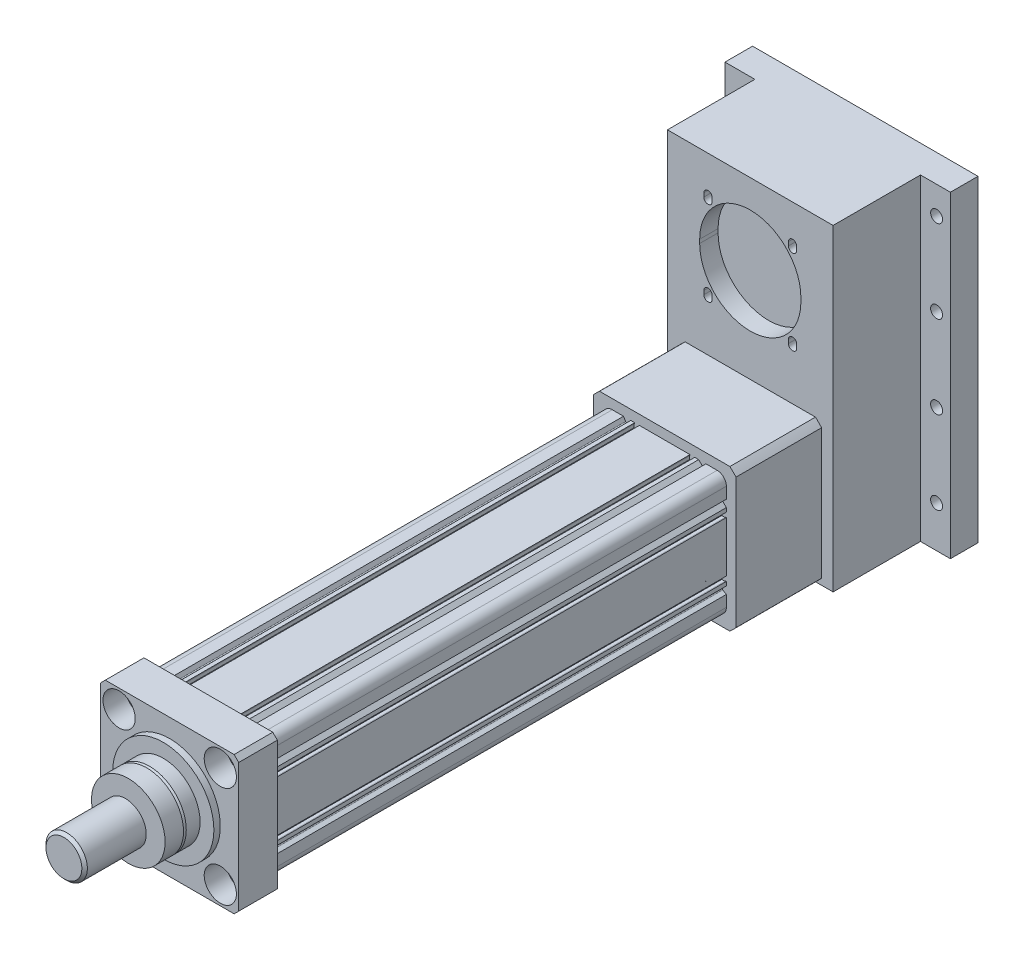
from build123d import *

# Parameters (mm, degrees)
SKETCH_1_R          = 6
EXTRUDE_1_DEPTH     = 496
EXTRUDE_1_2_DEPTH   = 42
SKETCH_3_R          = 6.5
SKETCH_3_R_2        = 8.5
CUT_EXTRUDE_1_DEPTH = 42
SKETCH_3_3_R        = 17.5
SKETCH_3_3_R_2      = 8.5
CUT_EXTRUDE_2_DEPTH = 24
SKETCH_3_4_R        = 55
EXTRUDE_2_DEPTH     = 7
SKETCH_4_R          = 40
EXTRUDE_3_DEPTH     = 18
CHAMFER_1_SIZE      = 3
CHAMFER_1_SIZE2     = 1.091910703
SKETCH_5_R          = 40
EXTRUDE_4_DEPTH     = 20
SKETCH_6_R          = 16.5
EXTRUDE_5_DEPTH     = 3
SKETCH_7_R          = 22.5
EXTRUDE_6_DEPTH     = 67
FILLET_1_R          = 1
CHAMFER_2_SIZE      = 3
EXTRUDE_7_DEPTH     = 93
SKETCH_12_W         = 180
SKETCH_12_H         = 345
EXTRUDE_9_DEPTH     = 95
CUT_EXTRUDE_5_DEPTH = 20
CUT_EXTRUDE_6_DEPTH = 20
SKETCH_16_W         = 245
SKETCH_16_H         = 345
SKETCH_16_R         = 6.5
EXTRUDE_10_DEPTH    = 30


with BuildPart() as part:
    # Sketch 1 → Extrude 1 (new body)
    with BuildSketch(Plane.XY):
        with BuildLine():
            Line((57, 67), (44.8, 67))
            Line((44.8, 67), (42.56486134, 63.12862628))
            ThreePointArc((42.56486134, 63.12862628), (41.829362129, 62.637181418), (40.991729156, 62.921519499))
            Line((40.991729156, 62.921519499), (36.913248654, 67))
            Line((36.913248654, 67), (32.6, 67))
            Line((32.6, 67), (32.6, 66.1))
            Line((32.6, 66.1), (33.2, 65.5))
            Line((33.2, 65.5), (33.2, 62))
            Line((33.2, 62), (26.9, 62))
            Line((26.9, 62), (26.9, 65.5))
            Line((26.9, 65.5), (27.5, 66.1))
            Line((27.5, 66.1), (27.5, 67))
            Line((27.5, 67), (0, 67))
            Line((0, 67), (-27.5, 67))
            Line((-27.5, 67), (-27.5, 66.1))
            Line((-27.5, 66.1), (-26.9, 65.5))
            Line((-26.9, 65.5), (-26.9, 62))
            Line((-26.9, 62), (-33.2, 62))
            Line((-33.2, 62), (-33.2, 65.5))
            Line((-33.2, 65.5), (-32.6, 66.1))
            Line((-32.6, 66.1), (-32.6, 67))
            Line((-32.6, 67), (-36.913248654, 67))
            Line((-36.913248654, 67), (-40.991729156, 62.921519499))
            ThreePointArc((-40.991729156, 62.921519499), (-41.829362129, 62.637181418), (-42.56486134, 63.12862628))
            Line((-42.56486134, 63.12862628), (-44.8, 67))
            Line((-44.8, 67), (-57, 67))
            ThreePointArc((-57, 67), (-64.071067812, 64.071067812), (-67, 57))
            Line((-67, 57), (-67, 44.8))
            Line((-67, 44.8), (-63.12862628, 42.56486134))
            ThreePointArc((-63.12862628, 42.56486134), (-62.637181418, 41.829362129), (-62.921519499, 40.991729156))
            Line((-62.921519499, 40.991729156), (-67, 36.913248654))
            Line((-67, 36.913248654), (-67, 32.6))
            Line((-67, 32.6), (-66.1, 32.6))
            Line((-66.1, 32.6), (-65.5, 33.2))
            Line((-65.5, 33.2), (-62, 33.2))
            Line((-62, 33.2), (-62, 26.9))
            Line((-62, 26.9), (-65.5, 26.9))
            Line((-65.5, 26.9), (-66.1, 27.5))
            Line((-66.1, 27.5), (-67, 27.5))
            Line((-67, 27.5), (-67, 0))
            Line((-67, 0), (-67, -27.5))
            Line((-67, -27.5), (-66.1, -27.5))
            Line((-66.1, -27.5), (-65.5, -26.9))
            Line((-65.5, -26.9), (-62, -26.9))
            Line((-62, -26.9), (-62, -33.2))
            Line((-62, -33.2), (-65.5, -33.2))
            Line((-65.5, -33.2), (-66.1, -32.6))
            Line((-66.1, -32.6), (-67, -32.6))
            Line((-67, -32.6), (-67, -36.913248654))
            Line((-67, -36.913248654), (-62.921519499, -40.991729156))
            ThreePointArc((-62.921519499, -40.991729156), (-62.637181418, -41.829362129), (-63.12862628, -42.56486134))
            Line((-63.12862628, -42.56486134), (-67, -44.8))
            Line((-67, -44.8), (-67, -57))
            ThreePointArc((-67, -57), (-64.071067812, -64.071067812), (-57, -67))
            Line((-57, -67), (-44.8, -67))
            Line((-44.8, -67), (-42.56486134, -63.12862628))
            ThreePointArc((-42.56486134, -63.12862628), (-41.829362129, -62.637181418), (-40.991729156, -62.921519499))
            Line((-40.991729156, -62.921519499), (-36.913248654, -67))
            Line((-36.913248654, -67), (36.913248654, -67))
            Line((36.913248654, -67), (40.991729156, -62.921519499))
            ThreePointArc((40.991729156, -62.921519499), (41.829362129, -62.637181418), (42.56486134, -63.12862628))
            Line((42.56486134, -63.12862628), (44.8, -67))
            Line((44.8, -67), (57, -67))
            ThreePointArc((57, -67), (64.071067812, -64.071067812), (67, -57))
            Line((67, -57), (67, -44.8))
            Line((67, -44.8), (63.12862628, -42.56486134))
            ThreePointArc((63.12862628, -42.56486134), (62.637181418, -41.829362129), (62.921519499, -40.991729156))
            Line((62.921519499, -40.991729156), (67, -36.913248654))
            Line((67, -36.913248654), (67, -32.6))
            Line((67, -32.6), (66.1, -32.6))
            Line((66.1, -32.6), (65.5, -33.2))
            Line((65.5, -33.2), (62, -33.2))
            Line((62, -33.2), (62, -26.9))
            Line((62, -26.9), (65.5, -26.9))
            Line((65.5, -26.9), (66.1, -27.5))
            Line((66.1, -27.5), (67, -27.5))
            Line((67, -27.5), (67, 0))
            Line((67, 0), (67, 27.5))
            Line((67, 27.5), (66.1, 27.5))
            Line((66.1, 27.5), (65.5, 26.9))
            Line((65.5, 26.9), (62, 26.9))
            Line((62, 26.9), (62, 33.2))
            Line((62, 33.2), (65.5, 33.2))
            Line((65.5, 33.2), (66.1, 32.6))
            Line((66.1, 32.6), (67, 32.6))
            Line((67, 32.6), (67, 36.913248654))
            Line((67, 36.913248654), (62.921519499, 40.991729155))
            ThreePointArc((62.921519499, 40.991729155), (62.637181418, 41.829362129), (63.12862628, 42.56486134))
            Line((63.12862628, 42.56486134), (67, 44.8))
            Line((67, 44.8), (67, 57))
            ThreePointArc((67, 57), (64.071067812, 64.071067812), (57, 67))
        make_face()
        with Locations((-55, 55)):
            Circle(SKETCH_1_R, mode=Mode.SUBTRACT)
        with Locations((55, 55)):
            Circle(SKETCH_1_R, mode=Mode.SUBTRACT)
        with Locations((-55, -55)):
            Circle(SKETCH_1_R, mode=Mode.SUBTRACT)
        with Locations((55, -55)):
            Circle(SKETCH_1_R, mode=Mode.SUBTRACT)
        with BuildLine():
            Line((41.774779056, 51.785063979), (43.601329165, 54.94874157))
            ThreePointArc((43.601329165, 54.94874157), (43.701229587, 55.707560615), (43.235303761, 56.314766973))
            Line((43.235303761, 56.314766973), (39.616756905, 58.403935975))
            ThreePointArc((39.616756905, 58.403935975), (39.337726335, 58.513191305), (39.038853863, 58.534871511))
            Line((39.038853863, 58.534871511), (35.747329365, 58.277670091))
            ThreePointArc((35.747329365, 58.277670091), (35.481311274, 58.1068038), (35.28193171, 57.86142918))
            Line((35.28193171, 57.86142918), (34.274000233, 56.115640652))
            ThreePointArc((34.274000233, 56.115640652), (34.174099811, 55.356821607), (34.640025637, 54.749615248))
            Line((34.640025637, 54.749615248), (40.408753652, 51.419038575))
            ThreePointArc((40.408753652, 51.419038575), (41.167572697, 51.319138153), (41.774779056, 51.785063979))
        make_face(mode=Mode.SUBTRACT)
        with BuildLine():
            Line((51.785063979, 41.774779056), (54.94874157, 43.601329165))
            ThreePointArc((54.94874157, 43.601329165), (55.707560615, 43.701229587), (56.314766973, 43.235303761))
            Line((56.314766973, 43.235303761), (58.403935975, 39.616756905))
            ThreePointArc((58.403935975, 39.616756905), (58.513191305, 39.337726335), (58.534871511, 39.038853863))
            Line((58.534871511, 39.038853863), (58.277670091, 35.747329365))
            ThreePointArc((58.277670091, 35.747329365), (58.1068038, 35.481311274), (57.86142918, 35.28193171))
            Line((57.86142918, 35.28193171), (56.115640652, 34.274000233))
            ThreePointArc((56.115640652, 34.274000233), (55.356821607, 34.174099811), (54.749615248, 34.640025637))
            Line((54.749615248, 34.640025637), (51.419038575, 40.408753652))
            ThreePointArc((51.419038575, 40.408753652), (51.319138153, 41.167572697), (51.785063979, 41.774779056))
        make_face(mode=Mode.SUBTRACT)
        with BuildLine():
            Line((-57.86142918, 35.28193171), (-56.115640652, 34.274000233))
            ThreePointArc((-56.115640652, 34.274000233), (-55.356821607, 34.174099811), (-54.749615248, 34.640025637))
            Line((-54.749615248, 34.640025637), (-51.419038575, 40.408753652))
            ThreePointArc((-51.419038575, 40.408753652), (-51.319138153, 41.167572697), (-51.785063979, 41.774779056))
            Line((-51.785063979, 41.774779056), (-54.94874157, 43.601329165))
            ThreePointArc((-54.94874157, 43.601329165), (-55.707560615, 43.701229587), (-56.314766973, 43.235303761))
            Line((-56.314766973, 43.235303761), (-58.403935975, 39.616756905))
            ThreePointArc((-58.403935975, 39.616756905), (-58.513191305, 39.337726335), (-58.534871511, 39.038853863))
            Line((-58.534871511, 39.038853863), (-58.277670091, 35.747329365))
            ThreePointArc((-58.277670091, 35.747329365), (-58.1068038, 35.481311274), (-57.86142918, 35.28193171))
        make_face(mode=Mode.SUBTRACT)
        with BuildLine():
            Line((-33.360371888, -64.600232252), (-19.423193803, -64.600232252))
            ThreePointArc((-19.423193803, -64.600232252), (-18.434155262, -63.747889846), (-19.1311157, -62.643837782))
            ThreePointArc((-19.1311157, -62.643837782), (-26.690004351, -59.815496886), (-33.843674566, -56.079012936))
            ThreePointArc((-33.843674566, -56.079012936), (-34.851952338, -56.064348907), (-35.360371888, -56.935181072))
            Line((-35.360371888, -56.935181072), (-35.360371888, -62.600232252))
            Line((-35.360371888, -62.600232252), (-33.360371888, -64.600232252))
        make_face(mode=Mode.SUBTRACT)
        with BuildLine():
            Line((35.360371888, -62.600232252), (33.360371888, -64.600232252))
            Line((33.360371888, -64.600232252), (19.423193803, -64.600232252))
            ThreePointArc((19.423193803, -64.600232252), (18.434155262, -63.747889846), (19.1311157, -62.643837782))
            ThreePointArc((19.1311157, -62.643837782), (26.690004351, -59.815496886), (33.843674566, -56.079012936))
            ThreePointArc((33.843674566, -56.079012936), (34.851952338, -56.064348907), (35.360371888, -56.935181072))
            Line((35.360371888, -56.935181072), (35.360371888, -62.600232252))
        make_face(mode=Mode.SUBTRACT)
        with BuildLine():
            Line((51.785063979, -41.774779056), (54.94874157, -43.601329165))
            ThreePointArc((54.94874157, -43.601329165), (55.707560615, -43.701229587), (56.314766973, -43.235303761))
            Line((56.314766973, -43.235303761), (58.403935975, -39.616756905))
            ThreePointArc((58.403935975, -39.616756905), (58.513191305, -39.337726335), (58.534871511, -39.038853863))
            Line((58.534871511, -39.038853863), (58.277670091, -35.747329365))
            ThreePointArc((58.277670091, -35.747329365), (58.1068038, -35.481311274), (57.86142918, -35.28193171))
            Line((57.86142918, -35.28193171), (56.115640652, -34.274000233))
            ThreePointArc((56.115640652, -34.274000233), (55.356821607, -34.174099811), (54.749615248, -34.640025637))
            Line((54.749615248, -34.640025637), (51.419038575, -40.408753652))
            ThreePointArc((51.419038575, -40.408753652), (51.319138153, -41.167572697), (51.785063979, -41.774779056))
        make_face(mode=Mode.SUBTRACT)
        with BuildLine():
            Line((-57.86142918, -35.28193171), (-56.115640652, -34.274000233))
            ThreePointArc((-56.115640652, -34.274000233), (-55.356821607, -34.174099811), (-54.749615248, -34.640025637))
            Line((-54.749615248, -34.640025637), (-51.419038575, -40.408753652))
            ThreePointArc((-51.419038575, -40.408753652), (-51.319138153, -41.167572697), (-51.785063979, -41.774779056))
            Line((-51.785063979, -41.774779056), (-54.94874157, -43.601329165))
            ThreePointArc((-54.94874157, -43.601329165), (-55.707560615, -43.701229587), (-56.314766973, -43.235303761))
            Line((-56.314766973, -43.235303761), (-58.403935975, -39.616756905))
            ThreePointArc((-58.403935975, -39.616756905), (-58.513191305, -39.337726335), (-58.534871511, -39.038853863))
            Line((-58.534871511, -39.038853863), (-58.277670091, -35.747329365))
            ThreePointArc((-58.277670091, -35.747329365), (-58.1068038, -35.481311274), (-57.86142918, -35.28193171))
        make_face(mode=Mode.SUBTRACT)
        with BuildLine():
            Line((-41.774779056, 51.785063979), (-43.601329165, 54.94874157))
            ThreePointArc((-43.601329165, 54.94874157), (-43.701229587, 55.707560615), (-43.235303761, 56.314766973))
            Line((-43.235303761, 56.314766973), (-39.616756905, 58.403935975))
            ThreePointArc((-39.616756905, 58.403935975), (-39.337726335, 58.513191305), (-39.038853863, 58.534871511))
            Line((-39.038853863, 58.534871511), (-35.747329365, 58.277670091))
            ThreePointArc((-35.747329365, 58.277670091), (-35.481311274, 58.1068038), (-35.28193171, 57.86142918))
            Line((-35.28193171, 57.86142918), (-34.274000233, 56.115640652))
            ThreePointArc((-34.274000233, 56.115640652), (-34.174099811, 55.356821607), (-34.640025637, 54.749615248))
            Line((-34.640025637, 54.749615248), (-40.408753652, 51.419038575))
            ThreePointArc((-40.408753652, 51.419038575), (-41.167572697, 51.319138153), (-41.774779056, 51.785063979))
        make_face(mode=Mode.SUBTRACT)
        with BuildLine():
            ThreePointArc((62.5, 0), (0, 62.5), (-62.5, 0))
            ThreePointArc((-62.5, 0), (0, -62.5), (62.5, 0))
        make_face(mode=Mode.SUBTRACT)
    extrude(amount=EXTRUDE_1_DEPTH)

    # Sketch 2 → Extrude 1 2 (add)
    with BuildSketch(Plane.XY.offset(496)):
        Polygon((-75, 70), (-70, 75), (70, 75), (75, 70), (75, -70), (70, -75), (-70, -75), (-75, -70), align=None)
    extrude(amount=EXTRUDE_1_2_DEPTH)

    # Sketch 3 → Cut-Extrude 1 (cut)
    with BuildSketch(Plane.XY.offset(538)):
        with Locations((-85, 20)):
            Circle(SKETCH_3_R)
        with Locations((-85, -20)):
            Circle(SKETCH_3_R)
        with Locations((-85, -60)):
            Circle(SKETCH_3_R)
        with Locations((-55, -55)):
            Circle(SKETCH_3_R_2)
        with Locations((-55, 55)):
            Circle(SKETCH_3_R_2)
        with Locations((55, 55)):
            Circle(SKETCH_3_R_2)
        with Locations((85, 60)):
            Circle(SKETCH_3_R)
        with Locations((85, 20)):
            Circle(SKETCH_3_R)
        with Locations((85, -20)):
            Circle(SKETCH_3_R)
        with Locations((85, -60)):
            Circle(SKETCH_3_R)
        with Locations((55, -55)):
            Circle(SKETCH_3_R_2)
        with Locations((-85, 60)):
            Circle(SKETCH_3_R)
    extrude(amount=-CUT_EXTRUDE_1_DEPTH, mode=Mode.SUBTRACT)

    # Sketch 3_3 → Cut-Extrude 2 (cut)
    # profile 1 of 4: a face of its own
    with BuildSketch(Plane.XY.offset(538)):
        with Locations((55, 55)):
            Circle(SKETCH_3_3_R)
        with Locations((55, 55)):
            Circle(SKETCH_3_3_R_2, mode=Mode.SUBTRACT)
    # profile 2 of 4: a face of its own
    with BuildSketch(Plane.XY.offset(538)):
        with Locations((55, -55)):
            Circle(SKETCH_3_3_R)
        with Locations((55, -55)):
            Circle(SKETCH_3_3_R_2, mode=Mode.SUBTRACT)
    # profile 3 of 4: a face of its own
    with BuildSketch(Plane.XY.offset(538)):
        with Locations((-55, -55)):
            Circle(SKETCH_3_3_R)
        with Locations((-55, -55)):
            Circle(SKETCH_3_3_R_2, mode=Mode.SUBTRACT)
    # profile 4 of 4: a face of its own
    with BuildSketch(Plane.XY.offset(538)):
        with Locations((-55, 55)):
            Circle(SKETCH_3_3_R)
    extrude(amount=-CUT_EXTRUDE_2_DEPTH, mode=Mode.SUBTRACT)

    # Sketch 3_4 → Extrude 2 (add)
    with BuildSketch(Plane.XY.offset(538)):
        with Locations(Location((0, 0, 0), (0, 0, 180))):
            Circle(SKETCH_3_4_R)
    extrude(amount=EXTRUDE_2_DEPTH)

    # Sketch 4 → Extrude 3 (add)
    with BuildSketch(Plane.XY.offset(545)):
        Circle(SKETCH_4_R)
    extrude(amount=EXTRUDE_3_DEPTH)

    # Chamfer 1
    chamfer_1_edges = [part.edges().sort_by_distance(p)[0] for p in [
        (-40, 0, 563),
    ]]
    chamfer_1_side = [part.faces().sort_by_distance(p)[0] for p in [
        (-40, 0, 554),
    ]]
    chamfer(chamfer_1_edges, length=CHAMFER_1_SIZE, length2=CHAMFER_1_SIZE2, reference=chamfer_1_side[0])

    # Sketch 5 → Extrude 4 (add)
    with BuildSketch(Plane.XY.offset(563)):
        Circle(SKETCH_5_R)
    extrude(amount=EXTRUDE_4_DEPTH)

    # Sketch 6 → Extrude 5 (add)
    with BuildSketch(Plane.XY.offset(583)):
        Circle(SKETCH_6_R)
    extrude(amount=EXTRUDE_5_DEPTH)

    # Sketch 7 → Extrude 6 (add)
    with BuildSketch(Plane.XY.offset(586)):
        Circle(SKETCH_7_R)
    extrude(amount=EXTRUDE_6_DEPTH)

    # Fillet 1
    fillet_1_edges = [part.edges().sort_by_distance(p)[0] for p in [
        (-16.5, 0, 583),
    ]]
    fillet(fillet_1_edges, radius=FILLET_1_R)

    # Chamfer 2
    chamfer_2_edges = [part.edges().sort_by_distance(p)[0] for p in [
        (-22.5, 0, 653),
    ]]
    chamfer(chamfer_2_edges, length=CHAMFER_2_SIZE)

    # Sketch 8 → Extrude 7 (add)
    with BuildSketch(Plane(origin=(0, 0, 0), x_dir=(-1, 0, 0), z_dir=(0, 0, -1))):
        with BuildLine():
            Line((-70.843136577, 77.5), (70.843136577, 77.5))
            ThreePointArc((70.843136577, 77.5), (74.246212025, 74.246212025), (77.5, 70.843136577))
            Line((77.5, 70.843136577), (77.5, -70.843136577))
            ThreePointArc((77.5, -70.843136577), (74.246212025, -74.246212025), (70.843136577, -77.5))
            Line((70.843136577, -77.5), (-70.843136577, -77.5))
            ThreePointArc((-70.843136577, -77.5), (-74.246212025, -74.246212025), (-77.5, -70.843136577))
            Line((-77.5, -70.843136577), (-77.5, 70.843136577))
            ThreePointArc((-77.5, 70.843136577), (-74.246212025, 74.246212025), (-70.843136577, 77.5))
        make_face()
    extrude(amount=EXTRUDE_7_DEPTH)

    # Sketch 12 → Extrude 9 (add)
    with BuildSketch(Plane(origin=(0, 0, -93), x_dir=(-1, 0, 0), z_dir=(0, 0, -1))):
        with Locations((0, 95)):
            Rectangle(SKETCH_12_W, SKETCH_12_H)
    extrude(amount=EXTRUDE_9_DEPTH)

    # Sketch 13 → Cut-Extrude 5 (cut)
    with BuildSketch(Plane.XY.offset(-93)):
        with BuildLine():
            Line((-55, 182), (-55, 178))
            ThreePointArc((-55, 178), (0, 123), (55, 178))
            Line((55, 178), (55, 182))
            ThreePointArc((55, 182), (0, 237), (-55, 182))
        make_face()
    extrude(amount=-CUT_EXTRUDE_5_DEPTH, mode=Mode.SUBTRACT)

    # Sketch 13_3 → Cut-Extrude 6 (cut)
    with BuildSketch(Plane.XY.offset(-93)):
        with BuildLine():
            Line((-50.461940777, 223.961940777), (-50.461940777, 227.961940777))
            ThreePointArc((-50.461940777, 227.961940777), (-45.961940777, 232.461940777), (-41.461940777, 227.961940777))
            Line((-41.461940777, 227.961940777), (-41.461940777, 223.961940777))
            ThreePointArc((-41.461940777, 223.961940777), (-45.961940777, 219.461940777), (-50.461940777, 223.961940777))
        make_face()
        with BuildLine():
            Line((50.461940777, 223.961940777), (50.461940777, 227.961940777))
            ThreePointArc((50.461940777, 227.961940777), (45.961940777, 232.461940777), (41.461940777, 227.961940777))
            Line((41.461940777, 227.961940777), (41.461940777, 223.961940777))
            ThreePointArc((41.461940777, 223.961940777), (45.961940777, 219.461940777), (50.461940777, 223.961940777))
        make_face()
        with BuildLine():
            Line((50.461940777, 136.038059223), (50.461940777, 132.038059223))
            ThreePointArc((50.461940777, 132.038059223), (45.961940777, 127.538059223), (41.461940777, 132.038059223))
            Line((41.461940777, 132.038059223), (41.461940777, 136.038059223))
            ThreePointArc((41.461940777, 136.038059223), (45.961940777, 140.538059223), (50.461940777, 136.038059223))
        make_face()
        with BuildLine():
            Line((-50.461940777, 136.038059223), (-50.461940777, 132.038059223))
            ThreePointArc((-50.461940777, 132.038059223), (-45.961940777, 127.538059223), (-41.461940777, 132.038059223))
            Line((-41.461940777, 132.038059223), (-41.461940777, 136.038059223))
            ThreePointArc((-41.461940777, 136.038059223), (-45.961940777, 140.538059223), (-50.461940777, 136.038059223))
        make_face()
    extrude(amount=-CUT_EXTRUDE_6_DEPTH, mode=Mode.SUBTRACT)

    # Sketch 16 → Extrude 10 (add)
    with BuildSketch(Plane(origin=(0, 0, -188), x_dir=(-1, 0, 0), z_dir=(0, 0, -1))):
        with Locations((0, 95)):
            Rectangle(SKETCH_16_W, SKETCH_16_H)
        with Locations((-107.5, 147.5)):
            Circle(SKETCH_16_R, mode=Mode.SUBTRACT)
        with Locations((-107.5, 57.5)):
            Circle(SKETCH_16_R, mode=Mode.SUBTRACT)
        with Locations((-107.5, -32.5)):
            Circle(SKETCH_16_R, mode=Mode.SUBTRACT)
        with Locations((-107.5, 237.5)):
            Circle(SKETCH_16_R, mode=Mode.SUBTRACT)
        with Locations(Location((107.5, -32.5, 0), (0, 0, 180))):
            Circle(SKETCH_16_R, mode=Mode.SUBTRACT)
        with Locations(Location((107.5, 57.5, 0), (0, 0, 180))):
            Circle(SKETCH_16_R, mode=Mode.SUBTRACT)
        with Locations(Location((107.5, 147.5, 0), (0, 0, 180))):
            Circle(SKETCH_16_R, mode=Mode.SUBTRACT)
        with Locations(Location((107.5, 237.5, 0), (0, 0, 180))):
            Circle(SKETCH_16_R, mode=Mode.SUBTRACT)
    extrude(amount=EXTRUDE_10_DEPTH)


solid = part.part
